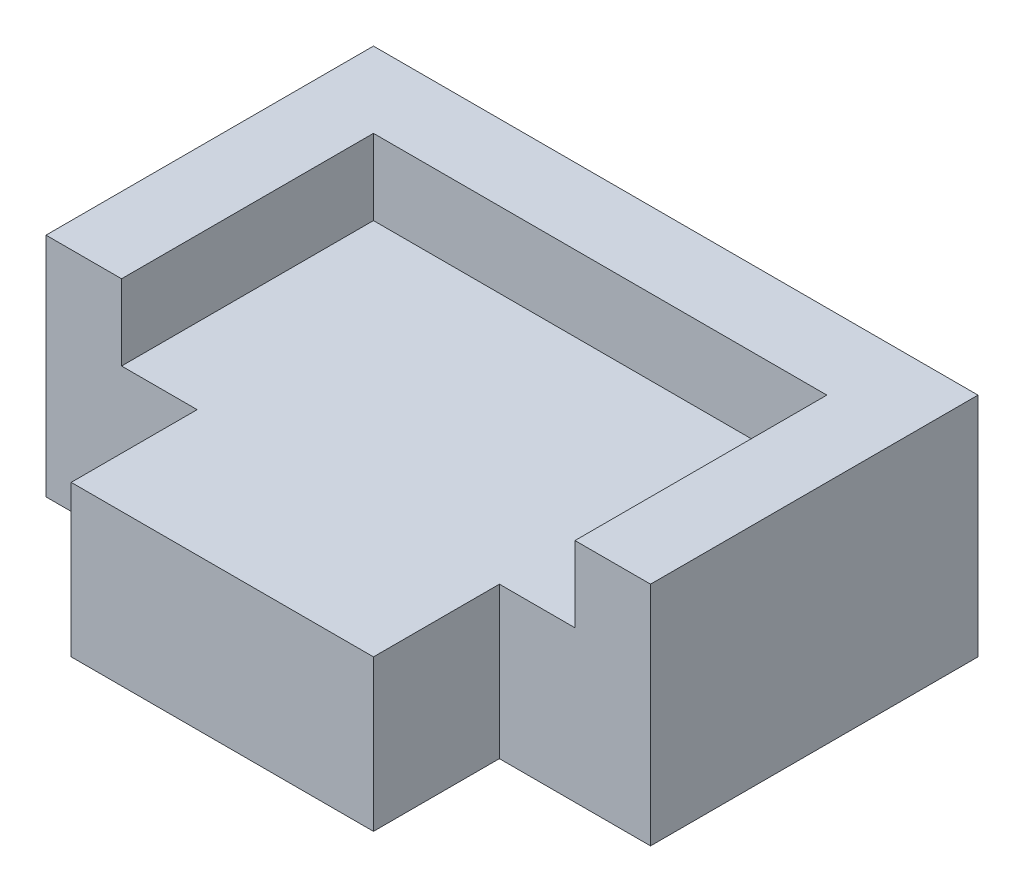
from build123d import *

# Parameters (mm, degrees)
SKETCH_1_W      = 90
SKETCH_1_H      = 50
EXTRUDE_1_DEPTH = 30
EXTRUDE_2_DEPTH = 45
SKETCH_2_W      = 60
SKETCH_2_H      = 30
EXTRUDE_3_DEPTH = 25


with BuildPart() as part:
    # Sketch 1 → Extrude 1 (new body)
    with BuildSketch(Plane(origin=(0, 0, 0), x_dir=(1, 0, 0), z_dir=(0, 1, 0))):
        with Locations((0, -40)):
            Rectangle(SKETCH_1_W, SKETCH_1_H)
    extrude(amount=EXTRUDE_1_DEPTH)

    # Sketch 1_3 → Extrude 2 (add)
    with BuildSketch(Plane(origin=(0, 0, 0), x_dir=(1, 0, 0), z_dir=(0, 1, 0))):
        Polygon((60, 0), (-60, 0), (-60, -65), (-45, -65), (-45, -15), (45, -15), (45, -65), (60, -65), align=None)
    extrude(amount=EXTRUDE_2_DEPTH)

    # Sketch 2 → Extrude 3 (add)
    with BuildSketch(Plane.XY.offset(65)):
        with Locations((0, 15)):
            Rectangle(SKETCH_2_W, SKETCH_2_H)
    extrude(amount=EXTRUDE_3_DEPTH)


solid = part.part
